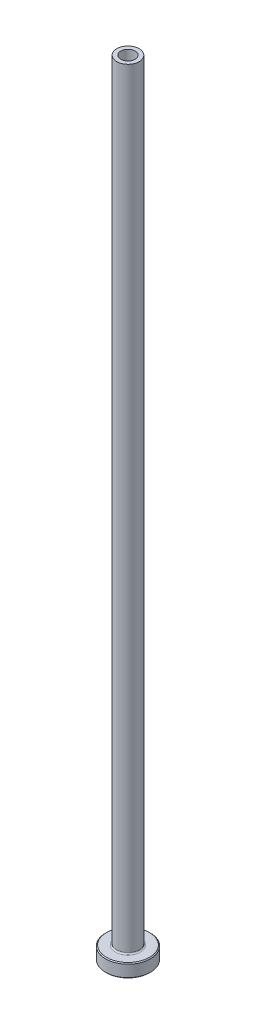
ISO-10303-21;
HEADER;
FILE_DESCRIPTION(('STEP AP214'),'2;1');
FILE_NAME('part.step','',(''),(''),'','','');
FILE_SCHEMA(('AUTOMOTIVE_DESIGN { 1 0 10303 214 1 1 1 1 }'));
ENDSEC;
DATA;
#1=APPLICATION_CONTEXT('core data for automotive mechanical design processes');
#2=APPLICATION_PROTOCOL_DEFINITION('international standard','automotive_design',2000,#1);
#3=PRODUCT_CONTEXT('',#1,'mechanical');
#4=PRODUCT('Part','Part','',(#3));
#5=PRODUCT_RELATED_PRODUCT_CATEGORY('part','',(#4));
#6=PRODUCT_DEFINITION_FORMATION('','',#4);
#7=PRODUCT_DEFINITION_CONTEXT('part definition',#1,'design');
#8=PRODUCT_DEFINITION('design','',#6,#7);
#9=PRODUCT_DEFINITION_SHAPE('','',#8);
#10=(LENGTH_UNIT() NAMED_UNIT(*) SI_UNIT(.MILLI.,.METRE.));
#11=(NAMED_UNIT(*) PLANE_ANGLE_UNIT() SI_UNIT($,.RADIAN.));
#12=(NAMED_UNIT(*) SI_UNIT($,.STERADIAN.) SOLID_ANGLE_UNIT());
#13=UNCERTAINTY_MEASURE_WITH_UNIT(LENGTH_MEASURE(1.E-05),#10,'distance_accuracy_value','');
#14=(GEOMETRIC_REPRESENTATION_CONTEXT(3) GLOBAL_UNCERTAINTY_ASSIGNED_CONTEXT((#13)) GLOBAL_UNIT_ASSIGNED_CONTEXT((#10,
#11,#12)) REPRESENTATION_CONTEXT('',''));
#15=CARTESIAN_POINT('',(0.,0.,0.));
#16=DIRECTION('',(0.,0.,1.));
#17=DIRECTION('',(1.,0.,0.));
#18=AXIS2_PLACEMENT_3D('',#15,#16,#17);
#19=CARTESIAN_POINT('',(0.,92.1876809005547,0.));
#20=DIRECTION('',(0.,1.,0.));
#21=DIRECTION('',(0.,0.,1.));
#22=AXIS2_PLACEMENT_3D('',#19,#20,#21);
#23=CYLINDRICAL_SURFACE('',#22,1.6);
#24=CARTESIAN_POINT('',(0.,175.,0.));
#25=DIRECTION('',(0.,1.,0.));
#26=DIRECTION('',(0.,0.,1.));
#27=AXIS2_PLACEMENT_3D('',#24,#25,#26);
#28=CIRCLE('',#27,1.6);
#29=CARTESIAN_POINT('',(0.,175.,1.6));
#30=VERTEX_POINT('',#29);
#31=EDGE_CURVE('E62',#30,#30,#28,.T.);
#32=ORIENTED_EDGE('',*,*,#31,.T.);
#33=EDGE_LOOP('',(#32));
#34=FACE_BOUND('',#33,.T.);
#35=CARTESIAN_POINT('',(0.,130.,0.));
#36=DIRECTION('',(0.,1.,0.));
#37=DIRECTION('',(0.,0.,1.));
#38=AXIS2_PLACEMENT_3D('',#35,#36,#37);
#39=CIRCLE('',#38,1.6);
#40=CARTESIAN_POINT('',(0.,130.,1.6));
#41=VERTEX_POINT('',#40);
#42=EDGE_CURVE('E71',#41,#41,#39,.T.);
#43=ORIENTED_EDGE('',*,*,#42,.F.);
#44=EDGE_LOOP('',(#43));
#45=FACE_BOUND('',#44,.T.);
#46=ADVANCED_FACE('F30',(#34,#45),#23,.F.);
#47=CARTESIAN_POINT('',(-1.6,175.,0.));
#48=DIRECTION('',(0.,1.,0.));
#49=DIRECTION('',(0.,0.,1.));
#50=AXIS2_PLACEMENT_3D('',#47,#48,#49);
#51=PLANE('',#50);
#52=CARTESIAN_POINT('',(0.,175.,0.));
#53=DIRECTION('',(0.,1.,0.));
#54=DIRECTION('',(0.,0.,1.));
#55=AXIS2_PLACEMENT_3D('',#52,#53,#54);
#56=CIRCLE('',#55,2.50000000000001);
#57=CARTESIAN_POINT('',(0.,175.,2.50000000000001));
#58=VERTEX_POINT('',#57);
#59=EDGE_CURVE('E65',#58,#58,#56,.T.);
#60=ORIENTED_EDGE('',*,*,#59,.T.);
#61=EDGE_LOOP('',(#60));
#62=FACE_BOUND('',#61,.T.);
#63=ORIENTED_EDGE('',*,*,#31,.F.);
#64=EDGE_LOOP('',(#63));
#65=FACE_BOUND('',#64,.T.);
#66=ADVANCED_FACE('F79',(#62,#65),#51,.T.);
#67=CARTESIAN_POINT('',(0.,92.1876809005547,0.));
#68=DIRECTION('',(0.,1.,0.));
#69=DIRECTION('',(0.,0.,1.));
#70=AXIS2_PLACEMENT_3D('',#67,#68,#69);
#71=CYLINDRICAL_SURFACE('',#70,2.5);
#72=CARTESIAN_POINT('',(0.,3.3,0.));
#73=DIRECTION('',(0.,1.,0.));
#74=DIRECTION('',(0.,0.,1.));
#75=AXIS2_PLACEMENT_3D('',#72,#73,#74);
#76=CIRCLE('',#75,2.5);
#77=CARTESIAN_POINT('',(0.,3.3,2.5));
#78=VERTEX_POINT('',#77);
#79=EDGE_CURVE('E59',#78,#78,#76,.T.);
#80=ORIENTED_EDGE('',*,*,#79,.T.);
#81=EDGE_LOOP('',(#80));
#82=FACE_BOUND('',#81,.T.);
#83=ORIENTED_EDGE('',*,*,#59,.F.);
#84=EDGE_LOOP('',(#83));
#85=FACE_BOUND('',#84,.T.);
#86=ADVANCED_FACE('F85',(#82,#85),#71,.T.);
#87=CARTESIAN_POINT('',(-2.49999999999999,3.,0.));
#88=DIRECTION('',(0.,1.,0.));
#89=DIRECTION('',(0.,0.,1.));
#90=AXIS2_PLACEMENT_3D('',#87,#88,#89);
#91=PLANE('',#90);
#92=CARTESIAN_POINT('',(0.,3.,0.));
#93=DIRECTION('',(0.,1.,0.));
#94=DIRECTION('',(0.,0.,1.));
#95=AXIS2_PLACEMENT_3D('',#92,#93,#94);
#96=CIRCLE('',#95,4.8);
#97=CARTESIAN_POINT('',(0.,3.,4.8));
#98=VERTEX_POINT('',#97);
#99=EDGE_CURVE('E53',#98,#98,#96,.T.);
#100=ORIENTED_EDGE('',*,*,#99,.T.);
#101=EDGE_LOOP('',(#100));
#102=FACE_BOUND('',#101,.T.);
#103=CARTESIAN_POINT('',(0.,3.,0.));
#104=DIRECTION('',(0.,1.,0.));
#105=DIRECTION('',(0.,0.,1.));
#106=AXIS2_PLACEMENT_3D('',#103,#104,#105);
#107=CIRCLE('',#106,2.8);
#108=CARTESIAN_POINT('',(0.,3.,2.8));
#109=VERTEX_POINT('',#108);
#110=EDGE_CURVE('E56',#109,#109,#107,.F.);
#111=ORIENTED_EDGE('',*,*,#110,.T.);
#112=EDGE_LOOP('',(#111));
#113=FACE_BOUND('',#112,.T.);
#114=ADVANCED_FACE('F111',(#102,#113),#91,.T.);
#115=CARTESIAN_POINT('',(0.,92.1876809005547,0.));
#116=DIRECTION('',(0.,1.,0.));
#117=DIRECTION('',(0.,0.,1.));
#118=AXIS2_PLACEMENT_3D('',#115,#116,#117);
#119=CYLINDRICAL_SURFACE('',#118,4.99999999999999);
#120=CARTESIAN_POINT('',(0.,2.8,0.));
#121=DIRECTION('',(0.,1.,0.));
#122=DIRECTION('',(0.,0.,1.));
#123=AXIS2_PLACEMENT_3D('',#120,#121,#122);
#124=CIRCLE('',#123,4.99999999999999);
#125=CARTESIAN_POINT('',(0.,2.8,4.99999999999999));
#126=VERTEX_POINT('',#125);
#127=EDGE_CURVE('E45',#126,#126,#124,.F.);
#128=ORIENTED_EDGE('',*,*,#127,.T.);
#129=EDGE_LOOP('',(#128));
#130=FACE_BOUND('',#129,.T.);
#131=CARTESIAN_POINT('',(0.,0.200000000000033,0.));
#132=DIRECTION('',(0.,-1.,0.));
#133=DIRECTION('',(0.,0.,-1.));
#134=AXIS2_PLACEMENT_3D('',#131,#132,#133);
#135=CIRCLE('',#134,4.99999999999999);
#136=CARTESIAN_POINT('',(0.,0.200000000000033,-4.99999999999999));
#137=VERTEX_POINT('',#136);
#138=EDGE_CURVE('E50',#137,#137,#135,.F.);
#139=ORIENTED_EDGE('',*,*,#138,.T.);
#140=EDGE_LOOP('',(#139));
#141=FACE_BOUND('',#140,.T.);
#142=ADVANCED_FACE('F108',(#130,#141),#119,.T.);
#143=CARTESIAN_POINT('',(-4.99999999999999,0.,0.));
#144=DIRECTION('',(0.,-1.,0.));
#145=DIRECTION('',(0.,0.,-1.));
#146=AXIS2_PLACEMENT_3D('',#143,#144,#145);
#147=PLANE('',#146);
#148=CARTESIAN_POINT('',(0.,0.,0.));
#149=DIRECTION('',(0.,-1.,0.));
#150=DIRECTION('',(0.,0.,-1.));
#151=AXIS2_PLACEMENT_3D('',#148,#149,#150);
#152=CIRCLE('',#151,2.34999999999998);
#153=CARTESIAN_POINT('',(0.,0.,-2.34999999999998));
#154=VERTEX_POINT('',#153);
#155=EDGE_CURVE('E37',#154,#154,#152,.F.);
#156=ORIENTED_EDGE('',*,*,#155,.T.);
#157=EDGE_LOOP('',(#156));
#158=FACE_BOUND('',#157,.T.);
#159=CARTESIAN_POINT('',(0.,0.,0.));
#160=DIRECTION('',(0.,-1.,0.));
#161=DIRECTION('',(0.,0.,-1.));
#162=AXIS2_PLACEMENT_3D('',#159,#160,#161);
#163=CIRCLE('',#162,4.79999999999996);
#164=CARTESIAN_POINT('',(0.,0.,-4.79999999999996));
#165=VERTEX_POINT('',#164);
#166=EDGE_CURVE('E41',#165,#165,#163,.T.);
#167=ORIENTED_EDGE('',*,*,#166,.T.);
#168=EDGE_LOOP('',(#167));
#169=FACE_BOUND('',#168,.T.);
#170=ADVANCED_FACE('F110',(#158,#169),#147,.T.);
#171=CARTESIAN_POINT('',(0.,92.1876809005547,0.));
#172=DIRECTION('',(0.,1.,0.));
#173=DIRECTION('',(0.,0.,1.));
#174=AXIS2_PLACEMENT_3D('',#171,#172,#173);
#175=CYLINDRICAL_SURFACE('',#174,1.85);
#176=CARTESIAN_POINT('',(0.,0.5,0.));
#177=DIRECTION('',(0.,-1.,0.));
#178=DIRECTION('',(0.,0.,-1.));
#179=AXIS2_PLACEMENT_3D('',#176,#177,#178);
#180=CIRCLE('',#179,1.85);
#181=CARTESIAN_POINT('',(0.,0.5,-1.85));
#182=VERTEX_POINT('',#181);
#183=EDGE_CURVE('E10',#182,#182,#180,.T.);
#184=ORIENTED_EDGE('',*,*,#183,.T.);
#185=EDGE_LOOP('',(#184));
#186=FACE_BOUND('',#185,.T.);
#187=CARTESIAN_POINT('',(0.,118.,0.));
#188=DIRECTION('',(0.,1.,0.));
#189=DIRECTION('',(0.,0.,1.));
#190=AXIS2_PLACEMENT_3D('',#187,#188,#189);
#191=CIRCLE('',#190,1.85);
#192=CARTESIAN_POINT('',(0.,118.,1.85));
#193=VERTEX_POINT('',#192);
#194=EDGE_CURVE('E68',#193,#193,#191,.T.);
#195=ORIENTED_EDGE('',*,*,#194,.T.);
#196=EDGE_LOOP('',(#195));
#197=FACE_BOUND('',#196,.T.);
#198=ADVANCED_FACE('F118',(#186,#197),#175,.F.);
#199=CARTESIAN_POINT('',(0.,118.,0.));
#200=DIRECTION('',(0.,-1.,0.));
#201=DIRECTION('',(0.,0.,-1.));
#202=AXIS2_PLACEMENT_3D('',#199,#200,#201);
#203=CONICAL_SURFACE('',#202,1.85,0.0208303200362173);
#204=ORIENTED_EDGE('',*,*,#42,.T.);
#205=EDGE_LOOP('',(#204));
#206=FACE_BOUND('',#205,.T.);
#207=ORIENTED_EDGE('',*,*,#194,.F.);
#208=EDGE_LOOP('',(#207));
#209=FACE_BOUND('',#208,.T.);
#210=ADVANCED_FACE('F75',(#206,#209),#203,.F.);
#211=CARTESIAN_POINT('',(0.,3.3,0.));
#212=DIRECTION('',(0.,1.,0.));
#213=DIRECTION('',(0.,0.,1.));
#214=AXIS2_PLACEMENT_3D('',#211,#212,#213);
#215=TOROIDAL_SURFACE('',#214,2.8,0.3);
#216=ORIENTED_EDGE('',*,*,#110,.F.);
#217=EDGE_LOOP('',(#216));
#218=FACE_BOUND('',#217,.T.);
#219=ORIENTED_EDGE('',*,*,#79,.F.);
#220=EDGE_LOOP('',(#219));
#221=FACE_BOUND('',#220,.T.);
#222=ADVANCED_FACE('F90',(#218,#221),#215,.F.);
#223=CARTESIAN_POINT('',(0.,3.,0.));
#224=DIRECTION('',(0.,-1.,0.));
#225=DIRECTION('',(0.,0.,-1.));
#226=AXIS2_PLACEMENT_3D('',#223,#224,#225);
#227=CONICAL_SURFACE('',#226,4.8,0.785398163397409);
#228=ORIENTED_EDGE('',*,*,#127,.F.);
#229=EDGE_LOOP('',(#228));
#230=FACE_BOUND('',#229,.T.);
#231=ORIENTED_EDGE('',*,*,#99,.F.);
#232=EDGE_LOOP('',(#231));
#233=FACE_BOUND('',#232,.T.);
#234=ADVANCED_FACE('F93',(#230,#233),#227,.T.);
#235=CARTESIAN_POINT('',(0.,0.200000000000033,0.));
#236=DIRECTION('',(0.,1.,0.));
#237=DIRECTION('',(0.,0.,1.));
#238=AXIS2_PLACEMENT_3D('',#235,#236,#237);
#239=CONICAL_SURFACE('',#238,4.99999999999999,0.785398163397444);
#240=ORIENTED_EDGE('',*,*,#166,.F.);
#241=EDGE_LOOP('',(#240));
#242=FACE_BOUND('',#241,.T.);
#243=ORIENTED_EDGE('',*,*,#138,.F.);
#244=EDGE_LOOP('',(#243));
#245=FACE_BOUND('',#244,.T.);
#246=ADVANCED_FACE('F96',(#242,#245),#239,.T.);
#247=CARTESIAN_POINT('',(0.,0.,0.));
#248=DIRECTION('',(0.,-1.,0.));
#249=DIRECTION('',(0.,0.,-1.));
#250=AXIS2_PLACEMENT_3D('',#247,#248,#249);
#251=CONICAL_SURFACE('',#250,2.34999999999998,0.785398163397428);
#252=ORIENTED_EDGE('',*,*,#183,.F.);
#253=EDGE_LOOP('',(#252));
#254=FACE_BOUND('',#253,.T.);
#255=ORIENTED_EDGE('',*,*,#155,.F.);
#256=EDGE_LOOP('',(#255));
#257=FACE_BOUND('',#256,.T.);
#258=ADVANCED_FACE('F32',(#254,#257),#251,.F.);
#259=CLOSED_SHELL('',(#46,#66,#86,#114,#142,#170,#198,#210,#222,#234,#246,#258));
#260=MANIFOLD_SOLID_BREP('B2',#259);
#261=ADVANCED_BREP_SHAPE_REPRESENTATION('',(#18,#260),#14);
#262=SHAPE_DEFINITION_REPRESENTATION(#9,#261);
ENDSEC;
END-ISO-10303-21;
